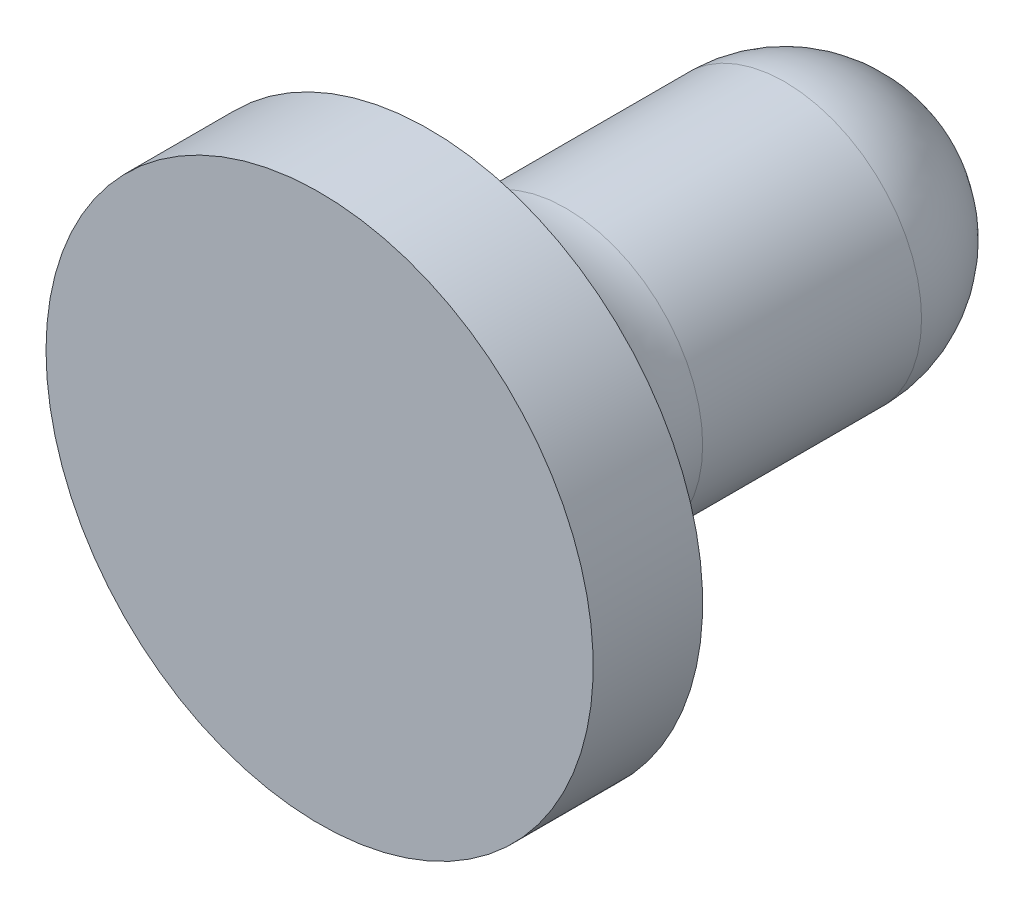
from build123d import *


with BuildPart() as part:
    # Sketch 1 → Revolve 1 (revolve)
    with BuildSketch(Plane(origin=(0, 0, 0), x_dir=(1, 0, 0), z_dir=(0, 1, 0)), mode=Mode.PRIVATE) as revolve_1_sk:
        with BuildLine():
            Line((0, 0), (50, 0))
            Line((50, 0), (50, 20))
            ThreePointArc((50, 20), (32.32233047, 27.32233047), (25, 45))
            Line((25, 45), (25, 85))
            ThreePointArc((25, 85), (17.67766953, 102.67766953), (0, 110))
            Line((0, 110), (0, 0))
        make_face()
    revolve(revolve_1_sk.sketch.rotate(Axis((0, 0, -110), (0, 0, 1)), 180), axis=Axis((0, 0, -110), (0, 0, 1)))


solid = part.part
